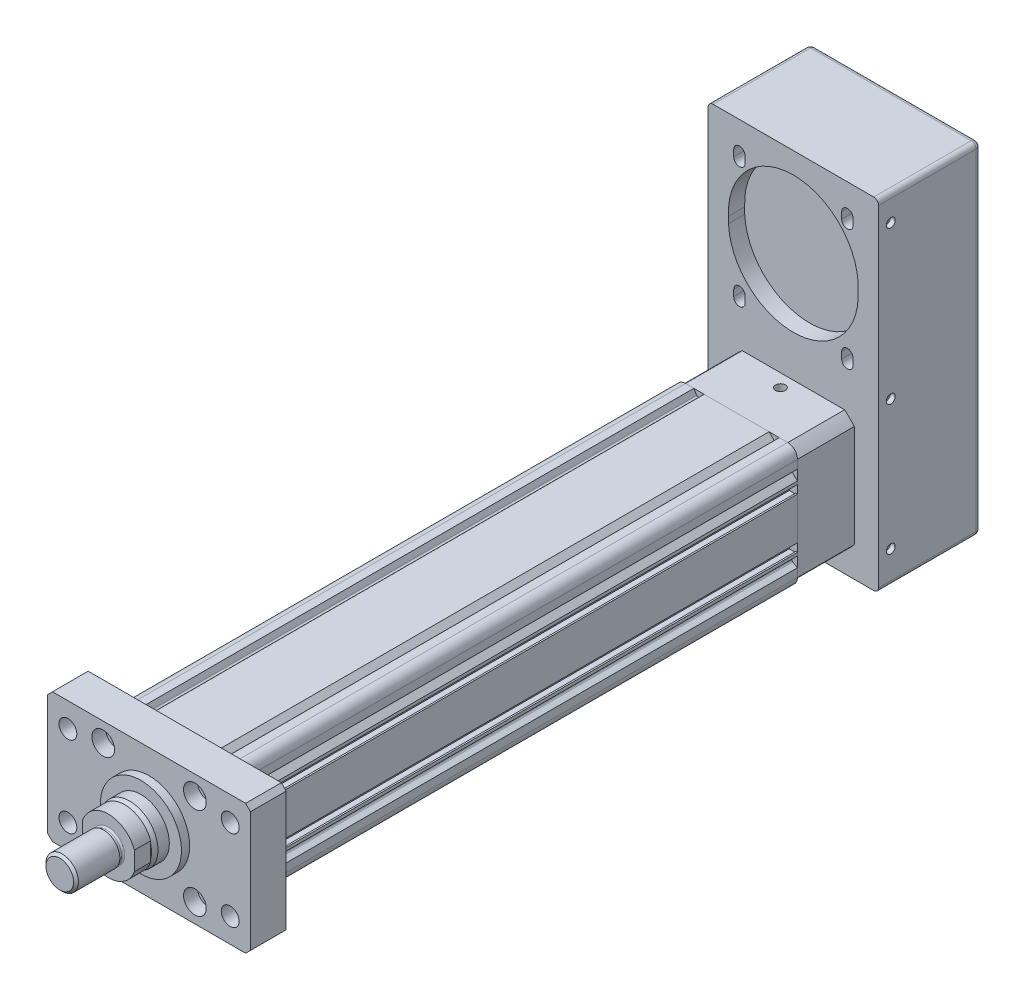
from build123d import *

# Parameters (mm, degrees)
SKETCH_1_R           = 31.5
SKETCH_1_R_2         = 3.35
EXTRUDE_1_DEPTH      = 340
SKETCH_2_R           = 5.5
SKETCH_2_R_2         = 4.25
EXTRUDE_1_2_DEPTH    = 22
SKETCH_3_R           = 7
SKETCH_3_R_2         = 4.25
CUT_EXTRUDE_1_DEPTH  = 8.5
SKETCH_3_3_R         = 25
EXTRUDE_2_DEPTH      = 5
SKETCH_5_R           = 17.5
EXTRUDE_3_DEPTH      = 10
CHAMFER_1_SIZE       = 3
CHAMFER_1_SIZE2      = 1
EXTRUDE_4_DEPTH      = 10
SKETCH_8_R           = 9
EXTRUDE_5_DEPTH      = 3
SKETCH_9_R           = 10
EXTRUDE_6_DEPTH      = 27
CHAMFER_2_SIZE       = 1.5
FILLET_1_R           = 1
EXTRUDE_7_DEPTH      = 35
SKETCH_11_R          = 3
CUT_EXTRUDE_2_DEPTH  = 5
SKETCH_18_W          = 105
SKETCH_18_H          = 210
EXTRUDE_11_DEPTH     = 63
CUT_EXTRUDE_7_DEPTH  = 10
CUT_EXTRUDE_START    = -10
CUT_EXTRUDE_9_DEPTH  = 5
SKETCH_21_R          = 2.75
CUT_EXTRUDE_10_DEPTH = 3
SKETCH_22_R          = 2.75
CUT_EXTRUDE_11_DEPTH = 3
FILLET_2_R           = 3


with BuildPart() as part:
    # Sketch 1 → Extrude 1 (new body)
    with BuildSketch(Plane.XY):
        with BuildLine():
            Line((-31.5, 37.5), (-26.33, 37.5))
            Line((-26.33, 37.5), (-24.66467188, 34.615567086))
            ThreePointArc((-24.66467188, 34.615567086), (-23.929172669, 34.124122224), (-23.091539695, 34.408460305))
            Line((-23.091539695, 34.408460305), (-20, 37.5))
            Line((-20, 37.5), (20, 37.5))
            Line((20, 37.5), (23.091539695, 34.408460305))
            ThreePointArc((23.091539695, 34.408460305), (23.929172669, 34.124122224), (24.66467188, 34.615567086))
            Line((24.66467188, 34.615567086), (26.33, 37.5))
            Line((26.33, 37.5), (31.5, 37.5))
            ThreePointArc((31.5, 37.5), (35.742640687, 35.742640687), (37.5, 31.5))
            Line((37.5, 31.5), (37.5, 26.33))
            Line((37.5, 26.33), (34.615567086, 24.66467188))
            ThreePointArc((34.615567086, 24.66467188), (34.124122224, 23.929172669), (34.408460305, 23.091539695))
            Line((34.408460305, 23.091539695), (37.5, 20))
            Line((37.5, 20), (37.5, 18.1))
            Line((37.5, 18.1), (36.5, 18.1))
            Line((36.5, 18.1), (36.5, 18.7))
            Line((36.5, 18.7), (32.5, 18.7))
            Line((32.5, 18.7), (32.5, 12.4))
            Line((32.5, 12.4), (36.5, 12.4))
            Line((36.5, 12.4), (36.5, 13))
            Line((36.5, 13), (37.5, 13))
            Line((37.5, 13), (37.5, -13))
            Line((37.5, -13), (36.5, -13))
            Line((36.5, -13), (36.5, -12.4))
            Line((36.5, -12.4), (32.5, -12.4))
            Line((32.5, -12.4), (32.5, -18.7))
            Line((32.5, -18.7), (36.5, -18.7))
            Line((36.5, -18.7), (36.5, -18.1))
            Line((36.5, -18.1), (37.5, -18.1))
            Line((37.5, -18.1), (37.5, -20))
            Line((37.5, -20), (34.408460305, -23.091539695))
            ThreePointArc((34.408460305, -23.091539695), (34.124122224, -23.929172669), (34.615567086, -24.66467188))
            Line((34.615567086, -24.66467188), (37.5, -26.33))
            Line((37.5, -26.33), (37.5, -31.5))
            ThreePointArc((37.5, -31.5), (35.742640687, -35.742640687), (31.5, -37.5))
            Line((31.5, -37.5), (26.33, -37.5))
            Line((26.33, -37.5), (24.66467188, -34.615567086))
            ThreePointArc((24.66467188, -34.615567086), (23.929172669, -34.124122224), (23.091539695, -34.408460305))
            Line((23.091539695, -34.408460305), (20, -37.5))
            Line((20, -37.5), (18.1, -37.5))
            Line((18.1, -37.5), (18.1, -36.5))
            Line((18.1, -36.5), (18.7, -36.5))
            Line((18.7, -36.5), (18.7, -33.945032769))
            Line((18.7, -33.945032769), (12.4, -33.945032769))
            Line((12.4, -33.945032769), (12.4, -36.5))
            Line((12.4, -36.5), (13, -36.5))
            Line((13, -36.5), (13, -37.5))
            Line((13, -37.5), (-13, -37.5))
            Line((-13, -37.5), (-13, -36.5))
            Line((-13, -36.5), (-12.4, -36.5))
            Line((-12.4, -36.5), (-12.4, -33.945032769))
            Line((-12.4, -33.945032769), (-18.7, -33.945032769))
            Line((-18.7, -33.945032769), (-18.7, -36.5))
            Line((-18.7, -36.5), (-18.1, -36.5))
            Line((-18.1, -36.5), (-18.1, -37.5))
            Line((-18.1, -37.5), (-20, -37.5))
            Line((-20, -37.5), (-23.091539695, -34.408460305))
            ThreePointArc((-23.091539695, -34.408460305), (-23.929172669, -34.124122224), (-24.66467188, -34.615567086))
            Line((-24.66467188, -34.615567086), (-26.33, -37.5))
            Line((-26.33, -37.5), (-31.5, -37.5))
            ThreePointArc((-31.5, -37.5), (-35.742640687, -35.742640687), (-37.5, -31.5))
            Line((-37.5, -31.5), (-37.5, -26.33))
            Line((-37.5, -26.33), (-34.615567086, -24.66467188))
            ThreePointArc((-34.615567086, -24.66467188), (-34.124122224, -23.929172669), (-34.408460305, -23.091539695))
            Line((-34.408460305, -23.091539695), (-37.5, -20))
            Line((-37.5, -20), (-37.5, -18.1))
            Line((-37.5, -18.1), (-36.5, -18.1))
            Line((-36.5, -18.1), (-36.5, -18.7))
            Line((-36.5, -18.7), (-32.5, -18.7))
            Line((-32.5, -18.7), (-32.5, -12.4))
            Line((-32.5, -12.4), (-36.5, -12.4))
            Line((-36.5, -12.4), (-36.5, -13))
            Line((-36.5, -13), (-37.5, -13))
            Line((-37.5, -13), (-37.5, 13))
            Line((-37.5, 13), (-36.5, 13))
            Line((-36.5, 13), (-36.5, 12.4))
            Line((-36.5, 12.4), (-32.5, 12.4))
            Line((-32.5, 12.4), (-32.5, 18.7))
            Line((-32.5, 18.7), (-36.5, 18.7))
            Line((-36.5, 18.7), (-36.5, 18.1))
            Line((-36.5, 18.1), (-37.5, 18.1))
            Line((-37.5, 18.1), (-37.5, 20))
            Line((-37.5, 20), (-34.408460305, 23.091539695))
            ThreePointArc((-34.408460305, 23.091539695), (-34.124122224, 23.929172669), (-34.615567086, 24.66467188))
            Line((-34.615567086, 24.66467188), (-37.5, 26.33))
            Line((-37.5, 26.33), (-37.5, 31.5))
            ThreePointArc((-37.5, 31.5), (-35.742640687, 35.742640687), (-31.5, 37.5))
        make_face()
        Circle(SKETCH_1_R, mode=Mode.SUBTRACT)
        with Locations((-28.25, 28.25)):
            Circle(SKETCH_1_R_2, mode=Mode.SUBTRACT)
        with Locations(Location((28.25, 28.25, 0), (0, 0, 180))):
            Circle(SKETCH_1_R_2, mode=Mode.SUBTRACT)
        with Locations((28.25, -28.25)):
            Circle(SKETCH_1_R_2, mode=Mode.SUBTRACT)
        with Locations(Location((-28.25, -28.25, 0), (0, 0, 180))):
            Circle(SKETCH_1_R_2, mode=Mode.SUBTRACT)
    extrude(amount=EXTRUDE_1_DEPTH)


with BuildPart() as body_2:
    # Sketch 2 → Extrude 1 2 (new body)
    with BuildSketch(Plane.XY.offset(340)):
        Polygon((-62.5, 37), (-59.5, 40), (59.5, 40), (62.5, 37), (62.5, -37), (59.5, -40), (-59.5, -40), (-62.5, -37), align=None)
        with Locations((-50, 25)):
            Circle(SKETCH_2_R, mode=Mode.SUBTRACT)
        with Locations((-28.25, 28.25)):
            Circle(SKETCH_2_R_2, mode=Mode.SUBTRACT)
        with Locations(Location((28.25, 28.25, 0), (0, 0, 180))):
            Circle(SKETCH_2_R_2, mode=Mode.SUBTRACT)
        with Locations(Location((50, 25, 0), (0, 0, 180))):
            Circle(SKETCH_2_R, mode=Mode.SUBTRACT)
        with Locations(Location((-50, -25, 0), (0, 0, 180))):
            Circle(SKETCH_2_R, mode=Mode.SUBTRACT)
        with Locations(Location((-28.25, -28.25, 0), (0, 0, 180))):
            Circle(SKETCH_2_R_2, mode=Mode.SUBTRACT)
        with Locations((50, -25)):
            Circle(SKETCH_2_R, mode=Mode.SUBTRACT)
        with Locations((28.25, -28.25)):
            Circle(SKETCH_2_R_2, mode=Mode.SUBTRACT)
    extrude(amount=EXTRUDE_1_2_DEPTH)

    # Sketch 3 → Cut-Extrude 1 (cut)
    # profile 1 of 4: a face of its own
    with BuildSketch(Plane.XY.offset(362)):
        with Locations((28.25, -28.25)):
            Circle(SKETCH_3_R)
        with Locations((28.25, -28.25)):
            Circle(SKETCH_3_R_2, mode=Mode.SUBTRACT)
    # profile 2 of 4: a face of its own
    with BuildSketch(Plane.XY.offset(362)):
        with Locations((-28.25, -28.25)):
            Circle(SKETCH_3_R)
        with Locations(Location((-28.25, -28.25, 0), (0, 0, 180))):
            Circle(SKETCH_3_R_2, mode=Mode.SUBTRACT)
    # profile 3 of 4: a face of its own
    with BuildSketch(Plane.XY.offset(362)):
        with Locations((-28.25, 28.25)):
            Circle(SKETCH_3_R)
    # profile 4 of 4: a face of its own
    with BuildSketch(Plane.XY.offset(362)):
        with Locations((28.25, 28.25)):
            Circle(SKETCH_3_R)
    extrude(amount=-CUT_EXTRUDE_1_DEPTH, mode=Mode.SUBTRACT)

    # Sketch 3_3 → Extrude 2 (add)
    with BuildSketch(Plane.XY.offset(362)):
        Circle(SKETCH_3_3_R)
    extrude(amount=EXTRUDE_2_DEPTH)

    # Sketch 5 → Extrude 3 (add)
    with BuildSketch(Plane.XY.offset(367)):
        Circle(SKETCH_5_R)
    extrude(amount=EXTRUDE_3_DEPTH)

    # Chamfer 1
    chamfer_1_edges = [body_2.edges().sort_by_distance(p)[0] for p in [
        (-17.5, 0, 377),
    ]]
    chamfer_1_side = [body_2.faces().sort_by_distance(p)[0] for p in [
        (-17.5, 0, 372),
    ]]
    chamfer(chamfer_1_edges, length=CHAMFER_1_SIZE, length2=CHAMFER_1_SIZE2, reference=chamfer_1_side[0])

    # Sketch 6 → Extrude 4 (add)
    with BuildSketch(Plane.XY.offset(377)):
        with BuildLine():
            Line((-16, 5.744562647), (-16, -5.744562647))
            ThreePointArc((-16, -5.744562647), (0, -17), (16, -5.744562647))
            Line((16, -5.744562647), (16, 5.744562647))
            ThreePointArc((16, 5.744562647), (0, 17), (-16, 5.744562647))
        make_face()
    extrude(amount=EXTRUDE_4_DEPTH)

    # Sketch 8 → Extrude 5 (add)
    with BuildSketch(Plane.XY.offset(387)):
        Circle(SKETCH_8_R)
    extrude(amount=EXTRUDE_5_DEPTH)

    # Sketch 9 → Extrude 6 (add)
    with BuildSketch(Plane.XY.offset(390)):
        Circle(SKETCH_9_R)
    extrude(amount=EXTRUDE_6_DEPTH)

    # Chamfer 2
    chamfer_2_edges = [body_2.edges().sort_by_distance(p)[0] for p in [
        (-10, 0, 417),
    ]]
    chamfer(chamfer_2_edges, length=CHAMFER_2_SIZE)

    # Fillet 1
    fillet_1_edges = [body_2.edges().sort_by_distance(p)[0] for p in [
        (-9, 0, 387),
    ]]
    fillet(fillet_1_edges, radius=FILLET_1_R)


with BuildPart() as body_3:
    # Sketch 10 → Extrude 7 (new body)
    with BuildSketch(Plane(origin=(0, 0, 0), x_dir=(-1, 0, 0), z_dir=(0, 0, -1))):
        with BuildLine():
            Line((-31.539657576, 37.5), (31.539657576, 37.5))
            ThreePointArc((31.539657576, 37.5), (34.648232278, 34.648232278), (37.5, 31.539657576))
            Line((37.5, 31.539657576), (37.5, -31.539657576))
            ThreePointArc((37.5, -31.539657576), (34.648232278, -34.648232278), (31.539657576, -37.5))
            Line((31.539657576, -37.5), (-31.539657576, -37.5))
            ThreePointArc((-31.539657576, -37.5), (-34.648232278, -34.648232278), (-37.5, -31.539657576))
            Line((-37.5, -31.539657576), (-37.5, 31.539657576))
            ThreePointArc((-37.5, 31.539657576), (-34.648232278, 34.648232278), (-31.539657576, 37.5))
        make_face()
    extrude(amount=EXTRUDE_7_DEPTH)

    # Sketch 11 → Cut-Extrude 2 (cut)
    with BuildSketch(Plane(origin=(0, 37.5, 0), x_dir=(1, 0, 0), z_dir=(0, 1, 0))):
        with Locations(Location((0, 27, 0), (0, 0, 270))):
            Circle(SKETCH_11_R)
    extrude(amount=-CUT_EXTRUDE_2_DEPTH, mode=Mode.SUBTRACT)

    # Sketch 18 → Extrude 11 (add)
    with BuildSketch(Plane(origin=(0, 0, -35), x_dir=(-1, 0, 0), z_dir=(0, 0, -1))):
        with Locations((0, 55)):
            Rectangle(SKETCH_18_W, SKETCH_18_H)
    extrude(amount=EXTRUDE_11_DEPTH)

    # Sketch 19 → Cut-Extrude 7 (cut)
    with BuildSketch(Plane.XY.offset(-35)):
        with BuildLine():
            Line((-40, 105), (-40, 101))
            ThreePointArc((-40, 101), (-0.049906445, 62.997504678), (39.90018711, 101))
            Line((39.90018711, 101), (39.90018711, 105))
            ThreePointArc((39.90018711, 105), (-0.049906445, 146.997504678), (-40, 105))
        make_face()
        with BuildLine():
            Line((-36.761032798, 138.332341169), (-36.761032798, 142.332341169))
            ThreePointArc((-36.761032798, 142.332341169), (-33.261032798, 145.832341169), (-29.761032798, 142.332341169))
            Line((-29.761032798, 142.332341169), (-29.761032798, 138.332341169))
            ThreePointArc((-29.761032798, 138.332341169), (-33.261032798, 134.832341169), (-36.761032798, 138.332341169))
        make_face()
        with BuildLine():
            Line((36.761032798, 138.332341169), (36.761032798, 142.332341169))
            ThreePointArc((36.761032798, 142.332341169), (33.261032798, 145.832341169), (29.761032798, 142.332341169))
            Line((29.761032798, 142.332341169), (29.761032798, 138.332341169))
            ThreePointArc((29.761032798, 138.332341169), (33.261032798, 134.832341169), (36.761032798, 138.332341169))
        make_face()
        with BuildLine():
            Line((36.761032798, 67.667658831), (36.761032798, 63.667658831))
            ThreePointArc((36.761032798, 63.667658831), (33.261032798, 60.167658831), (29.761032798, 63.667658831))
            Line((29.761032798, 63.667658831), (29.761032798, 67.667658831))
            ThreePointArc((29.761032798, 67.667658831), (33.261032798, 71.167658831), (36.761032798, 67.667658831))
        make_face()
        with BuildLine():
            Line((-36.761032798, 67.667658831), (-36.761032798, 63.667658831))
            ThreePointArc((-36.761032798, 63.667658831), (-33.261032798, 60.167658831), (-29.761032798, 63.667658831))
            Line((-29.761032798, 63.667658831), (-29.761032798, 67.667658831))
            ThreePointArc((-29.761032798, 67.667658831), (-33.261032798, 71.167658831), (-36.761032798, 67.667658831))
        make_face()
    extrude(amount=-CUT_EXTRUDE_7_DEPTH, mode=Mode.SUBTRACT)

    # Sketch 19_3 → Cut-Extrude 9 (cut)
    with BuildSketch(Plane.XY.offset(-35).offset(CUT_EXTRUDE_START)):
        with BuildLine():
            Line((-38.461032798, 138.282341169), (-38.461032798, 142.382341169))
            ThreePointArc((-38.461032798, 142.382341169), (-33.261032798, 147.582341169), (-28.061032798, 142.382341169))
            Line((-28.061032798, 142.382341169), (-28.061032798, 138.282341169))
            ThreePointArc((-28.061032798, 138.282341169), (-33.261032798, 133.082341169), (-38.461032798, 138.282341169))
        make_face()
        with BuildLine():
            Line((38.461032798, 138.282341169), (38.461032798, 142.382341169))
            ThreePointArc((38.461032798, 142.382341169), (33.261032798, 147.582341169), (28.061032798, 142.382341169))
            Line((28.061032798, 142.382341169), (28.061032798, 138.282341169))
            ThreePointArc((28.061032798, 138.282341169), (33.261032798, 133.082341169), (38.461032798, 138.282341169))
        make_face()
        with BuildLine():
            Line((38.461032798, 67.717658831), (38.461032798, 63.617658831))
            ThreePointArc((38.461032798, 63.617658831), (33.261032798, 58.417658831), (28.061032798, 63.617658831))
            Line((28.061032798, 63.617658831), (28.061032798, 67.717658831))
            ThreePointArc((28.061032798, 67.717658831), (33.261032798, 72.917658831), (38.461032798, 67.717658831))
        make_face()
        with BuildLine():
            Line((-38.461032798, 67.717658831), (-38.461032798, 63.617658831))
            ThreePointArc((-38.461032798, 63.617658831), (-33.261032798, 58.417658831), (-28.061032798, 63.617658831))
            Line((-28.061032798, 63.617658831), (-28.061032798, 67.717658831))
            ThreePointArc((-28.061032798, 67.717658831), (-33.261032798, 72.917658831), (-38.461032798, 67.717658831))
        make_face()
    extrude(amount=-CUT_EXTRUDE_9_DEPTH, mode=Mode.SUBTRACT)

    # Sketch 21 → Cut-Extrude 10 (cut)
    with BuildSketch(Plane.ZY.offset(52.5)):
        with Locations(Location((-42.5, -30, 0), (0, 0, 270))):
            Circle(SKETCH_21_R)
        with Locations(Location((-42.5, 55, 0), (0, 0, 270))):
            Circle(SKETCH_21_R)
        with Locations(Location((-42.5, 149, 0), (0, 0, 270))):
            Circle(SKETCH_21_R)
    extrude(amount=-CUT_EXTRUDE_10_DEPTH, mode=Mode.SUBTRACT)

    # Sketch 22 → Cut-Extrude 11 (cut)
    with BuildSketch(Plane(origin=(52.5, 0, 0), x_dir=(0, 0, -1), z_dir=(1, 0, 0))):
        with Locations(Location((42.5, -30, 0), (0, 0, 270))):
            Circle(SKETCH_22_R)
        with Locations(Location((42.5, 50, 0), (0, 0, 90))):
            Circle(SKETCH_22_R)
        with Locations(Location((42.5, 144, 0), (0, 0, 90))):
            Circle(SKETCH_22_R)
    extrude(amount=-CUT_EXTRUDE_11_DEPTH, mode=Mode.SUBTRACT)

    # Fillet 2
    fillet_2_edges = [body_3.edges().sort_by_distance(p)[0] for p in [
        (-52.5, -50, -66.5),
        (-52.5, 160, -66.5),
        (52.5, 160, -66.5),
        (52.5, -50, -66.5),
        (-52.5, 55, -98),
        (0, 160, -98),
        (52.5, 55, -98),
        (0, -50, -98),
    ]]
    fillet(fillet_2_edges, radius=FILLET_2_R)


solid = Compound([part.part, body_2.part, body_3.part])
